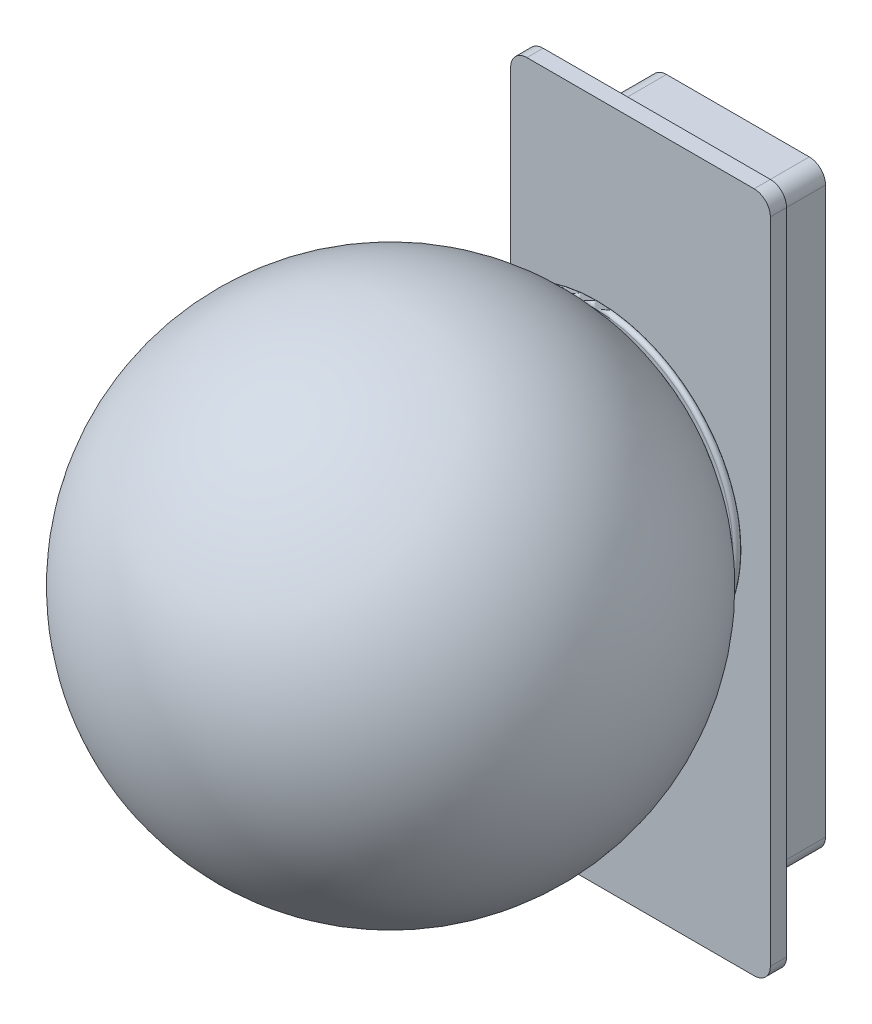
ISO-10303-21;
HEADER;
FILE_DESCRIPTION(('STEP AP214'),'2;1');
FILE_NAME('part.step','',(''),(''),'','','');
FILE_SCHEMA(('AUTOMOTIVE_DESIGN { 1 0 10303 214 1 1 1 1 }'));
ENDSEC;
DATA;
#1=APPLICATION_CONTEXT('core data for automotive mechanical design processes');
#2=APPLICATION_PROTOCOL_DEFINITION('international standard','automotive_design',2000,#1);
#3=PRODUCT_CONTEXT('',#1,'mechanical');
#4=PRODUCT('Part','Part','',(#3));
#5=PRODUCT_RELATED_PRODUCT_CATEGORY('part','',(#4));
#6=PRODUCT_DEFINITION_FORMATION('','',#4);
#7=PRODUCT_DEFINITION_CONTEXT('part definition',#1,'design');
#8=PRODUCT_DEFINITION('design','',#6,#7);
#9=PRODUCT_DEFINITION_SHAPE('','',#8);
#10=(LENGTH_UNIT() NAMED_UNIT(*) SI_UNIT(.MILLI.,.METRE.));
#11=(NAMED_UNIT(*) PLANE_ANGLE_UNIT() SI_UNIT($,.RADIAN.));
#12=(NAMED_UNIT(*) SI_UNIT($,.STERADIAN.) SOLID_ANGLE_UNIT());
#13=UNCERTAINTY_MEASURE_WITH_UNIT(LENGTH_MEASURE(1.E-05),#10,'distance_accuracy_value','');
#14=(GEOMETRIC_REPRESENTATION_CONTEXT(3) GLOBAL_UNCERTAINTY_ASSIGNED_CONTEXT((#13)) GLOBAL_UNIT_ASSIGNED_CONTEXT((#10,
#11,#12)) REPRESENTATION_CONTEXT('',''));
#15=CARTESIAN_POINT('',(0.,0.,0.));
#16=DIRECTION('',(0.,0.,1.));
#17=DIRECTION('',(1.,0.,0.));
#18=AXIS2_PLACEMENT_3D('',#15,#16,#17);
#19=CARTESIAN_POINT('',(0.,20.,85.));
#20=DIRECTION('',(0.,0.,-1.));
#21=DIRECTION('',(0.,-1.,0.));
#22=AXIS2_PLACEMENT_3D('',#19,#20,#21);
#23=SPHERICAL_SURFACE('',#22,80.);
#24=CARTESIAN_POINT('',(0.,20.,18.3372266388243));
#25=DIRECTION('',(0.,0.,-1.));
#26=DIRECTION('',(-1.,0.,0.));
#27=AXIS2_PLACEMENT_3D('',#24,#25,#26);
#28=CIRCLE('',#27,44.2275326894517);
#29=CARTESIAN_POINT('',(-44.2275326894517,20.,18.3372266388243));
#30=VERTEX_POINT('',#29);
#31=EDGE_CURVE('E11',#30,#30,#28,.T.);
#32=ORIENTED_EDGE('',*,*,#31,.T.);
#33=EDGE_LOOP('',(#32));
#34=FACE_BOUND('',#33,.T.);
#35=ADVANCED_FACE('F49',(#34),#23,.T.);
#36=CARTESIAN_POINT('',(0.,20.,19.1705113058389));
#37=DIRECTION('',(0.,0.,-1.));
#38=DIRECTION('',(-1.,0.,0.));
#39=AXIS2_PLACEMENT_3D('',#36,#37,#38);
#40=TOROIDAL_SURFACE('',#39,43.6746885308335,0.999999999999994);
#41=ORIENTED_EDGE('',*,*,#31,.F.);
#42=EDGE_LOOP('',(#41));
#43=FACE_BOUND('',#42,.T.);
#44=CARTESIAN_POINT('',(0.,20.,20.1705113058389));
#45=DIRECTION('',(0.,0.,-1.));
#46=DIRECTION('',(-1.,0.,0.));
#47=AXIS2_PLACEMENT_3D('',#44,#45,#46);
#48=CIRCLE('',#47,43.6746885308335);
#49=CARTESIAN_POINT('',(-43.6746885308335,20.,20.1705113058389));
#50=VERTEX_POINT('',#49);
#51=EDGE_CURVE('E56',#50,#50,#48,.T.);
#52=ORIENTED_EDGE('',*,*,#51,.T.);
#53=EDGE_LOOP('',(#52));
#54=FACE_BOUND('',#53,.T.);
#55=ADVANCED_FACE('F78',(#43,#54),#40,.T.);
#56=CARTESIAN_POINT('',(0.,63.6746885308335,20.1705113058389));
#57=DIRECTION('',(0.,0.,1.));
#58=DIRECTION('',(1.,0.,0.));
#59=AXIS2_PLACEMENT_3D('',#56,#57,#58);
#60=PLANE('',#59);
#61=CARTESIAN_POINT('',(0.,20.,20.1705113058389));
#62=DIRECTION('',(0.,0.,-1.));
#63=DIRECTION('',(-1.,0.,0.));
#64=AXIS2_PLACEMENT_3D('',#61,#62,#63);
#65=CIRCLE('',#64,42.4513171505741);
#66=CARTESIAN_POINT('',(-42.4513171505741,20.,20.1705113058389));
#67=VERTEX_POINT('',#66);
#68=EDGE_CURVE('E61',#67,#67,#65,.T.);
#69=ORIENTED_EDGE('',*,*,#68,.T.);
#70=EDGE_LOOP('',(#69));
#71=FACE_BOUND('',#70,.T.);
#72=ORIENTED_EDGE('',*,*,#51,.F.);
#73=EDGE_LOOP('',(#72));
#74=FACE_BOUND('',#73,.T.);
#75=ADVANCED_FACE('F69',(#71,#74),#60,.T.);
#76=CARTESIAN_POINT('',(0.,20.,81.9999999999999));
#77=DIRECTION('',(0.,0.,-1.));
#78=DIRECTION('',(0.,1.,0.));
#79=AXIS2_PLACEMENT_3D('',#76,#77,#78);
#80=SPHERICAL_SURFACE('',#79,75.);
#81=ORIENTED_EDGE('',*,*,#68,.F.);
#82=EDGE_LOOP('',(#81));
#83=FACE_BOUND('',#82,.T.);
#84=ADVANCED_FACE('F72',(#83),#80,.T.);
#85=CLOSED_SHELL('',(#35,#55,#75,#84));
#86=MANIFOLD_SOLID_BREP('B2',#85);
#87=CARTESIAN_POINT('',(-35.,-100.,0.));
#88=DIRECTION('',(0.,0.,1.));
#89=DIRECTION('',(1.,0.,0.));
#90=AXIS2_PLACEMENT_3D('',#87,#88,#89);
#91=PLANE('',#90);
#92=CARTESIAN_POINT('',(-35.,-100.,0.));
#93=DIRECTION('',(0.,0.,1.));
#94=DIRECTION('',(1.,0.,0.));
#95=AXIS2_PLACEMENT_3D('',#92,#93,#94);
#96=CIRCLE('',#95,5.);
#97=CARTESIAN_POINT('',(-40.,-100.,0.));
#98=VERTEX_POINT('',#97);
#99=CARTESIAN_POINT('',(-35.,-105.,0.));
#100=VERTEX_POINT('',#99);
#101=EDGE_CURVE('E401',#98,#100,#96,.T.);
#102=ORIENTED_EDGE('',*,*,#101,.F.);
#103=DIRECTION('',(0.,-1.,0.));
#104=VECTOR('',#103,1.);
#105=CARTESIAN_POINT('',(-40.,100.,0.));
#106=LINE('',#105,#104);
#107=CARTESIAN_POINT('',(-40.,100.,0.));
#108=VERTEX_POINT('',#107);
#109=EDGE_CURVE('E406',#108,#98,#106,.T.);
#110=ORIENTED_EDGE('',*,*,#109,.F.);
#111=CARTESIAN_POINT('',(-35.,100.,0.));
#112=DIRECTION('',(0.,0.,1.));
#113=DIRECTION('',(1.,0.,0.));
#114=AXIS2_PLACEMENT_3D('',#111,#112,#113);
#115=CIRCLE('',#114,5.);
#116=CARTESIAN_POINT('',(-35.,105.,0.));
#117=VERTEX_POINT('',#116);
#118=EDGE_CURVE('E433',#117,#108,#115,.T.);
#119=ORIENTED_EDGE('',*,*,#118,.F.);
#120=DIRECTION('',(-1.,0.,0.));
#121=VECTOR('',#120,1.);
#122=CARTESIAN_POINT('',(35.,105.,0.));
#123=LINE('',#122,#121);
#124=CARTESIAN_POINT('',(35.,105.,0.));
#125=VERTEX_POINT('',#124);
#126=EDGE_CURVE('E431',#125,#117,#123,.T.);
#127=ORIENTED_EDGE('',*,*,#126,.F.);
#128=CARTESIAN_POINT('',(35.,100.,0.));
#129=DIRECTION('',(0.,0.,1.));
#130=DIRECTION('',(1.,0.,0.));
#131=AXIS2_PLACEMENT_3D('',#128,#129,#130);
#132=CIRCLE('',#131,5.);
#133=CARTESIAN_POINT('',(40.,100.,0.));
#134=VERTEX_POINT('',#133);
#135=EDGE_CURVE('E429',#134,#125,#132,.T.);
#136=ORIENTED_EDGE('',*,*,#135,.F.);
#137=DIRECTION('',(0.,1.,0.));
#138=VECTOR('',#137,1.);
#139=CARTESIAN_POINT('',(40.,100.,0.));
#140=LINE('',#139,#138);
#141=CARTESIAN_POINT('',(40.,-100.,0.));
#142=VERTEX_POINT('',#141);
#143=EDGE_CURVE('E427',#142,#134,#140,.T.);
#144=ORIENTED_EDGE('',*,*,#143,.F.);
#145=CARTESIAN_POINT('',(35.,-100.,0.));
#146=DIRECTION('',(0.,0.,1.));
#147=DIRECTION('',(1.,0.,0.));
#148=AXIS2_PLACEMENT_3D('',#145,#146,#147);
#149=CIRCLE('',#148,5.);
#150=CARTESIAN_POINT('',(35.,-105.,0.));
#151=VERTEX_POINT('',#150);
#152=EDGE_CURVE('E425',#151,#142,#149,.T.);
#153=ORIENTED_EDGE('',*,*,#152,.F.);
#154=DIRECTION('',(1.,0.,0.));
#155=VECTOR('',#154,1.);
#156=CARTESIAN_POINT('',(35.,-105.,0.));
#157=LINE('',#156,#155);
#158=EDGE_CURVE('E423',#100,#151,#157,.T.);
#159=ORIENTED_EDGE('',*,*,#158,.F.);
#160=EDGE_LOOP('',(#102,#110,#119,#127,#136,#144,#153,#159));
#161=FACE_BOUND('',#160,.T.);
#162=CARTESIAN_POINT('',(-22.,-87.,0.));
#163=DIRECTION('',(0.,0.,-1.));
#164=DIRECTION('',(1.,0.,0.));
#165=AXIS2_PLACEMENT_3D('',#162,#163,#164);
#166=CIRCLE('',#165,5.);
#167=CARTESIAN_POINT('',(-22.,-92.,0.));
#168=VERTEX_POINT('',#167);
#169=CARTESIAN_POINT('',(-27.,-87.,0.));
#170=VERTEX_POINT('',#169);
#171=EDGE_CURVE('E131',#168,#170,#166,.T.);
#172=ORIENTED_EDGE('',*,*,#171,.F.);
#173=DIRECTION('',(-1.,0.,0.));
#174=VECTOR('',#173,1.);
#175=CARTESIAN_POINT('',(22.,-92.,0.));
#176=LINE('',#175,#174);
#177=CARTESIAN_POINT('',(22.,-92.,0.));
#178=VERTEX_POINT('',#177);
#179=EDGE_CURVE('E343',#178,#168,#176,.T.);
#180=ORIENTED_EDGE('',*,*,#179,.F.);
#181=CARTESIAN_POINT('',(22.,-87.,0.));
#182=DIRECTION('',(0.,0.,-1.));
#183=DIRECTION('',(1.,0.,0.));
#184=AXIS2_PLACEMENT_3D('',#181,#182,#183);
#185=CIRCLE('',#184,5.);
#186=CARTESIAN_POINT('',(27.,-87.,0.));
#187=VERTEX_POINT('',#186);
#188=EDGE_CURVE('E374',#187,#178,#185,.T.);
#189=ORIENTED_EDGE('',*,*,#188,.F.);
#190=DIRECTION('',(0.,-1.,0.));
#191=VECTOR('',#190,1.);
#192=CARTESIAN_POINT('',(27.,87.,0.));
#193=LINE('',#192,#191);
#194=CARTESIAN_POINT('',(27.,87.,0.));
#195=VERTEX_POINT('',#194);
#196=EDGE_CURVE('E371',#195,#187,#193,.T.);
#197=ORIENTED_EDGE('',*,*,#196,.F.);
#198=CARTESIAN_POINT('',(22.,87.,0.));
#199=DIRECTION('',(0.,0.,-1.));
#200=DIRECTION('',(-1.,0.,0.));
#201=AXIS2_PLACEMENT_3D('',#198,#199,#200);
#202=CIRCLE('',#201,5.);
#203=CARTESIAN_POINT('',(21.9999999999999,92.,0.));
#204=VERTEX_POINT('',#203);
#205=EDGE_CURVE('E368',#204,#195,#202,.T.);
#206=ORIENTED_EDGE('',*,*,#205,.F.);
#207=DIRECTION('',(1.,0.,0.));
#208=VECTOR('',#207,1.);
#209=CARTESIAN_POINT('',(-22.,92.,0.));
#210=LINE('',#209,#208);
#211=CARTESIAN_POINT('',(-22.,92.,0.));
#212=VERTEX_POINT('',#211);
#213=EDGE_CURVE('E365',#212,#204,#210,.T.);
#214=ORIENTED_EDGE('',*,*,#213,.F.);
#215=CARTESIAN_POINT('',(-22.,87.,0.));
#216=DIRECTION('',(0.,0.,-1.));
#217=DIRECTION('',(-1.,0.,0.));
#218=AXIS2_PLACEMENT_3D('',#215,#216,#217);
#219=CIRCLE('',#218,5.);
#220=CARTESIAN_POINT('',(-27.,87.,0.));
#221=VERTEX_POINT('',#220);
#222=EDGE_CURVE('E362',#221,#212,#219,.T.);
#223=ORIENTED_EDGE('',*,*,#222,.F.);
#224=DIRECTION('',(0.,1.,0.));
#225=VECTOR('',#224,1.);
#226=CARTESIAN_POINT('',(-27.,-87.,0.));
#227=LINE('',#226,#225);
#228=EDGE_CURVE('E359',#170,#221,#227,.T.);
#229=ORIENTED_EDGE('',*,*,#228,.F.);
#230=EDGE_LOOP('',(#172,#180,#189,#197,#206,#214,#223,#229));
#231=FACE_BOUND('',#230,.T.);
#232=ADVANCED_FACE('F108',(#161,#231),#91,.F.);
#233=CARTESIAN_POINT('',(-35.,-100.,5.));
#234=DIRECTION('',(0.,0.,-1.));
#235=DIRECTION('',(-1.,0.,0.));
#236=AXIS2_PLACEMENT_3D('',#233,#234,#235);
#237=CYLINDRICAL_SURFACE('',#236,5.);
#238=ORIENTED_EDGE('',*,*,#101,.T.);
#239=DIRECTION('',(0.,0.,-1.));
#240=VECTOR('',#239,1.);
#241=CARTESIAN_POINT('',(-35.,-105.,5.));
#242=LINE('',#241,#240);
#243=CARTESIAN_POINT('',(-35.,-105.,5.));
#244=VERTEX_POINT('',#243);
#245=EDGE_CURVE('E47',#244,#100,#242,.T.);
#246=ORIENTED_EDGE('',*,*,#245,.F.);
#247=CARTESIAN_POINT('',(-35.,-100.,5.));
#248=DIRECTION('',(0.,0.,1.));
#249=DIRECTION('',(1.,0.,0.));
#250=AXIS2_PLACEMENT_3D('',#247,#248,#249);
#251=CIRCLE('',#250,5.);
#252=CARTESIAN_POINT('',(-40.,-100.,5.));
#253=VERTEX_POINT('',#252);
#254=EDGE_CURVE('E402',#253,#244,#251,.T.);
#255=ORIENTED_EDGE('',*,*,#254,.F.);
#256=DIRECTION('',(0.,0.,-1.));
#257=VECTOR('',#256,1.);
#258=CARTESIAN_POINT('',(-40.,-100.,5.));
#259=LINE('',#258,#257);
#260=EDGE_CURVE('E420',#253,#98,#259,.T.);
#261=ORIENTED_EDGE('',*,*,#260,.T.);
#262=EDGE_LOOP('',(#238,#246,#255,#261));
#263=FACE_BOUND('',#262,.T.);
#264=ADVANCED_FACE('F110',(#263),#237,.T.);
#265=CARTESIAN_POINT('',(35.,-105.,5.));
#266=DIRECTION('',(0.,1.,0.));
#267=DIRECTION('',(0.,0.,1.));
#268=AXIS2_PLACEMENT_3D('',#265,#266,#267);
#269=PLANE('',#268);
#270=ORIENTED_EDGE('',*,*,#158,.T.);
#271=DIRECTION('',(0.,0.,-1.));
#272=VECTOR('',#271,1.);
#273=CARTESIAN_POINT('',(35.,-105.,5.));
#274=LINE('',#273,#272);
#275=CARTESIAN_POINT('',(35.,-105.,5.));
#276=VERTEX_POINT('',#275);
#277=EDGE_CURVE('E116',#276,#151,#274,.T.);
#278=ORIENTED_EDGE('',*,*,#277,.F.);
#279=DIRECTION('',(1.,0.,0.));
#280=VECTOR('',#279,1.);
#281=CARTESIAN_POINT('',(35.,-105.,5.));
#282=LINE('',#281,#280);
#283=EDGE_CURVE('E405',#244,#276,#282,.T.);
#284=ORIENTED_EDGE('',*,*,#283,.F.);
#285=ORIENTED_EDGE('',*,*,#245,.T.);
#286=EDGE_LOOP('',(#270,#278,#284,#285));
#287=FACE_BOUND('',#286,.T.);
#288=ADVANCED_FACE('F479',(#287),#269,.F.);
#289=CARTESIAN_POINT('',(35.,-100.,5.));
#290=DIRECTION('',(0.,0.,-1.));
#291=DIRECTION('',(-1.,0.,0.));
#292=AXIS2_PLACEMENT_3D('',#289,#290,#291);
#293=CYLINDRICAL_SURFACE('',#292,5.);
#294=ORIENTED_EDGE('',*,*,#152,.T.);
#295=DIRECTION('',(0.,0.,-1.));
#296=VECTOR('',#295,1.);
#297=CARTESIAN_POINT('',(40.,-100.,5.));
#298=LINE('',#297,#296);
#299=CARTESIAN_POINT('',(40.,-100.,5.));
#300=VERTEX_POINT('',#299);
#301=EDGE_CURVE('E450',#300,#142,#298,.T.);
#302=ORIENTED_EDGE('',*,*,#301,.F.);
#303=CARTESIAN_POINT('',(35.,-100.,5.));
#304=DIRECTION('',(0.,0.,1.));
#305=DIRECTION('',(1.,0.,0.));
#306=AXIS2_PLACEMENT_3D('',#303,#304,#305);
#307=CIRCLE('',#306,5.);
#308=EDGE_CURVE('E408',#276,#300,#307,.T.);
#309=ORIENTED_EDGE('',*,*,#308,.F.);
#310=ORIENTED_EDGE('',*,*,#277,.T.);
#311=EDGE_LOOP('',(#294,#302,#309,#310));
#312=FACE_BOUND('',#311,.T.);
#313=ADVANCED_FACE('F457',(#312),#293,.T.);
#314=CARTESIAN_POINT('',(40.,100.,5.));
#315=DIRECTION('',(-1.,0.,0.));
#316=DIRECTION('',(0.,-1.,0.));
#317=AXIS2_PLACEMENT_3D('',#314,#315,#316);
#318=PLANE('',#317);
#319=ORIENTED_EDGE('',*,*,#143,.T.);
#320=DIRECTION('',(0.,0.,-1.));
#321=VECTOR('',#320,1.);
#322=CARTESIAN_POINT('',(40.,100.,5.));
#323=LINE('',#322,#321);
#324=CARTESIAN_POINT('',(40.,100.,5.));
#325=VERTEX_POINT('',#324);
#326=EDGE_CURVE('E447',#325,#134,#323,.T.);
#327=ORIENTED_EDGE('',*,*,#326,.F.);
#328=DIRECTION('',(0.,1.,0.));
#329=VECTOR('',#328,1.);
#330=CARTESIAN_POINT('',(40.,100.,5.));
#331=LINE('',#330,#329);
#332=EDGE_CURVE('E410',#300,#325,#331,.T.);
#333=ORIENTED_EDGE('',*,*,#332,.F.);
#334=ORIENTED_EDGE('',*,*,#301,.T.);
#335=EDGE_LOOP('',(#319,#327,#333,#334));
#336=FACE_BOUND('',#335,.T.);
#337=ADVANCED_FACE('F467',(#336),#318,.F.);
#338=CARTESIAN_POINT('',(35.,100.,5.));
#339=DIRECTION('',(0.,0.,-1.));
#340=DIRECTION('',(-1.,0.,0.));
#341=AXIS2_PLACEMENT_3D('',#338,#339,#340);
#342=CYLINDRICAL_SURFACE('',#341,5.);
#343=ORIENTED_EDGE('',*,*,#135,.T.);
#344=DIRECTION('',(0.,0.,-1.));
#345=VECTOR('',#344,1.);
#346=CARTESIAN_POINT('',(35.,105.,5.));
#347=LINE('',#346,#345);
#348=CARTESIAN_POINT('',(35.,105.,5.));
#349=VERTEX_POINT('',#348);
#350=EDGE_CURVE('E444',#349,#125,#347,.T.);
#351=ORIENTED_EDGE('',*,*,#350,.F.);
#352=CARTESIAN_POINT('',(35.,100.,5.));
#353=DIRECTION('',(0.,0.,1.));
#354=DIRECTION('',(1.,0.,0.));
#355=AXIS2_PLACEMENT_3D('',#352,#353,#354);
#356=CIRCLE('',#355,5.);
#357=EDGE_CURVE('E412',#325,#349,#356,.T.);
#358=ORIENTED_EDGE('',*,*,#357,.F.);
#359=ORIENTED_EDGE('',*,*,#326,.T.);
#360=EDGE_LOOP('',(#343,#351,#358,#359));
#361=FACE_BOUND('',#360,.T.);
#362=ADVANCED_FACE('F471',(#361),#342,.T.);
#363=CARTESIAN_POINT('',(35.,105.,5.));
#364=DIRECTION('',(0.,-1.,0.));
#365=DIRECTION('',(0.,0.,-1.));
#366=AXIS2_PLACEMENT_3D('',#363,#364,#365);
#367=PLANE('',#366);
#368=ORIENTED_EDGE('',*,*,#126,.T.);
#369=DIRECTION('',(0.,0.,-1.));
#370=VECTOR('',#369,1.);
#371=CARTESIAN_POINT('',(-35.,105.,5.));
#372=LINE('',#371,#370);
#373=CARTESIAN_POINT('',(-35.,105.,5.));
#374=VERTEX_POINT('',#373);
#375=EDGE_CURVE('E441',#374,#117,#372,.T.);
#376=ORIENTED_EDGE('',*,*,#375,.F.);
#377=DIRECTION('',(-1.,0.,0.));
#378=VECTOR('',#377,1.);
#379=CARTESIAN_POINT('',(35.,105.,5.));
#380=LINE('',#379,#378);
#381=EDGE_CURVE('E414',#349,#374,#380,.T.);
#382=ORIENTED_EDGE('',*,*,#381,.F.);
#383=ORIENTED_EDGE('',*,*,#350,.T.);
#384=EDGE_LOOP('',(#368,#376,#382,#383));
#385=FACE_BOUND('',#384,.T.);
#386=ADVANCED_FACE('F492',(#385),#367,.F.);
#387=CARTESIAN_POINT('',(-35.,100.,5.));
#388=DIRECTION('',(0.,0.,-1.));
#389=DIRECTION('',(-1.,0.,0.));
#390=AXIS2_PLACEMENT_3D('',#387,#388,#389);
#391=CYLINDRICAL_SURFACE('',#390,5.);
#392=ORIENTED_EDGE('',*,*,#118,.T.);
#393=DIRECTION('',(0.,0.,-1.));
#394=VECTOR('',#393,1.);
#395=CARTESIAN_POINT('',(-40.,100.,5.));
#396=LINE('',#395,#394);
#397=CARTESIAN_POINT('',(-40.,100.,5.));
#398=VERTEX_POINT('',#397);
#399=EDGE_CURVE('E438',#398,#108,#396,.T.);
#400=ORIENTED_EDGE('',*,*,#399,.F.);
#401=CARTESIAN_POINT('',(-35.,100.,5.));
#402=DIRECTION('',(0.,0.,1.));
#403=DIRECTION('',(1.,0.,0.));
#404=AXIS2_PLACEMENT_3D('',#401,#402,#403);
#405=CIRCLE('',#404,5.);
#406=EDGE_CURVE('E416',#374,#398,#405,.T.);
#407=ORIENTED_EDGE('',*,*,#406,.F.);
#408=ORIENTED_EDGE('',*,*,#375,.T.);
#409=EDGE_LOOP('',(#392,#400,#407,#408));
#410=FACE_BOUND('',#409,.T.);
#411=ADVANCED_FACE('F490',(#410),#391,.T.);
#412=CARTESIAN_POINT('',(-40.,100.,5.));
#413=DIRECTION('',(1.,0.,0.));
#414=DIRECTION('',(0.,1.,0.));
#415=AXIS2_PLACEMENT_3D('',#412,#413,#414);
#416=PLANE('',#415);
#417=ORIENTED_EDGE('',*,*,#109,.T.);
#418=ORIENTED_EDGE('',*,*,#260,.F.);
#419=DIRECTION('',(0.,-1.,0.));
#420=VECTOR('',#419,1.);
#421=CARTESIAN_POINT('',(-40.,100.,5.));
#422=LINE('',#421,#420);
#423=EDGE_CURVE('E418',#398,#253,#422,.T.);
#424=ORIENTED_EDGE('',*,*,#423,.F.);
#425=ORIENTED_EDGE('',*,*,#399,.T.);
#426=EDGE_LOOP('',(#417,#418,#424,#425));
#427=FACE_BOUND('',#426,.T.);
#428=ADVANCED_FACE('F485',(#427),#416,.F.);
#429=CARTESIAN_POINT('',(-35.,-100.,5.));
#430=DIRECTION('',(0.,0.,1.));
#431=DIRECTION('',(1.,0.,0.));
#432=AXIS2_PLACEMENT_3D('',#429,#430,#431);
#433=PLANE('',#432);
#434=ORIENTED_EDGE('',*,*,#254,.T.);
#435=ORIENTED_EDGE('',*,*,#283,.T.);
#436=ORIENTED_EDGE('',*,*,#308,.T.);
#437=ORIENTED_EDGE('',*,*,#332,.T.);
#438=ORIENTED_EDGE('',*,*,#357,.T.);
#439=ORIENTED_EDGE('',*,*,#381,.T.);
#440=ORIENTED_EDGE('',*,*,#406,.T.);
#441=ORIENTED_EDGE('',*,*,#423,.T.);
#442=EDGE_LOOP('',(#434,#435,#436,#437,#438,#439,#440,#441));
#443=FACE_BOUND('',#442,.T.);
#444=ADVANCED_FACE('F475',(#443),#433,.T.);
#445=CARTESIAN_POINT('',(-22.,-87.,-25.));
#446=DIRECTION('',(0.,0.,1.));
#447=DIRECTION('',(1.,0.,0.));
#448=AXIS2_PLACEMENT_3D('',#445,#446,#447);
#449=CYLINDRICAL_SURFACE('',#448,5.);
#450=ORIENTED_EDGE('',*,*,#171,.T.);
#451=DIRECTION('',(0.,0.,1.));
#452=VECTOR('',#451,1.);
#453=CARTESIAN_POINT('',(-27.,-87.,-25.));
#454=LINE('',#453,#452);
#455=CARTESIAN_POINT('',(-27.,-87.,-25.));
#456=VERTEX_POINT('',#455);
#457=EDGE_CURVE('E398',#456,#170,#454,.T.);
#458=ORIENTED_EDGE('',*,*,#457,.F.);
#459=CARTESIAN_POINT('',(-22.,-87.,-25.));
#460=DIRECTION('',(0.,0.,-1.));
#461=DIRECTION('',(1.,0.,0.));
#462=AXIS2_PLACEMENT_3D('',#459,#460,#461);
#463=CIRCLE('',#462,5.);
#464=CARTESIAN_POINT('',(-22.,-92.,-25.));
#465=VERTEX_POINT('',#464);
#466=EDGE_CURVE('E339',#465,#456,#463,.T.);
#467=ORIENTED_EDGE('',*,*,#466,.F.);
#468=DIRECTION('',(0.,0.,1.));
#469=VECTOR('',#468,1.);
#470=CARTESIAN_POINT('',(-22.,-92.,-25.));
#471=LINE('',#470,#469);
#472=EDGE_CURVE('E357',#465,#168,#471,.T.);
#473=ORIENTED_EDGE('',*,*,#472,.T.);
#474=EDGE_LOOP('',(#450,#458,#467,#473));
#475=FACE_BOUND('',#474,.T.);
#476=ADVANCED_FACE('F513',(#475),#449,.T.);
#477=CARTESIAN_POINT('',(-27.,-87.,-25.));
#478=DIRECTION('',(1.,0.,0.));
#479=DIRECTION('',(0.,1.,0.));
#480=AXIS2_PLACEMENT_3D('',#477,#478,#479);
#481=PLANE('',#480);
#482=ORIENTED_EDGE('',*,*,#228,.T.);
#483=DIRECTION('',(0.,0.,1.));
#484=VECTOR('',#483,1.);
#485=CARTESIAN_POINT('',(-27.,87.,-25.));
#486=LINE('',#485,#484);
#487=CARTESIAN_POINT('',(-27.,87.,-25.));
#488=VERTEX_POINT('',#487);
#489=EDGE_CURVE('E395',#488,#221,#486,.T.);
#490=ORIENTED_EDGE('',*,*,#489,.F.);
#491=DIRECTION('',(0.,1.,0.));
#492=VECTOR('',#491,1.);
#493=CARTESIAN_POINT('',(-27.,-87.,-25.));
#494=LINE('',#493,#492);
#495=EDGE_CURVE('E342',#456,#488,#494,.T.);
#496=ORIENTED_EDGE('',*,*,#495,.F.);
#497=ORIENTED_EDGE('',*,*,#457,.T.);
#498=EDGE_LOOP('',(#482,#490,#496,#497));
#499=FACE_BOUND('',#498,.T.);
#500=ADVANCED_FACE('F517',(#499),#481,.F.);
#501=CARTESIAN_POINT('',(-22.,87.,-25.));
#502=DIRECTION('',(0.,0.,1.));
#503=DIRECTION('',(1.,0.,0.));
#504=AXIS2_PLACEMENT_3D('',#501,#502,#503);
#505=CYLINDRICAL_SURFACE('',#504,5.);
#506=ORIENTED_EDGE('',*,*,#222,.T.);
#507=DIRECTION('',(0.,0.,1.));
#508=VECTOR('',#507,1.);
#509=CARTESIAN_POINT('',(-22.,92.,-25.));
#510=LINE('',#509,#508);
#511=CARTESIAN_POINT('',(-22.,92.,-25.));
#512=VERTEX_POINT('',#511);
#513=EDGE_CURVE('E392',#512,#212,#510,.T.);
#514=ORIENTED_EDGE('',*,*,#513,.F.);
#515=CARTESIAN_POINT('',(-22.,87.,-25.));
#516=DIRECTION('',(0.,0.,-1.));
#517=DIRECTION('',(-1.,0.,0.));
#518=AXIS2_PLACEMENT_3D('',#515,#516,#517);
#519=CIRCLE('',#518,5.);
#520=EDGE_CURVE('E345',#488,#512,#519,.T.);
#521=ORIENTED_EDGE('',*,*,#520,.F.);
#522=ORIENTED_EDGE('',*,*,#489,.T.);
#523=EDGE_LOOP('',(#506,#514,#521,#522));
#524=FACE_BOUND('',#523,.T.);
#525=ADVANCED_FACE('F522',(#524),#505,.T.);
#526=CARTESIAN_POINT('',(-22.,92.,-25.));
#527=DIRECTION('',(0.,-1.,0.));
#528=DIRECTION('',(0.,0.,-1.));
#529=AXIS2_PLACEMENT_3D('',#526,#527,#528);
#530=PLANE('',#529);
#531=ORIENTED_EDGE('',*,*,#213,.T.);
#532=DIRECTION('',(0.,0.,1.));
#533=VECTOR('',#532,1.);
#534=CARTESIAN_POINT('',(21.9999999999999,92.,-25.));
#535=LINE('',#534,#533);
#536=CARTESIAN_POINT('',(21.9999999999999,92.,-25.));
#537=VERTEX_POINT('',#536);
#538=EDGE_CURVE('E389',#537,#204,#535,.T.);
#539=ORIENTED_EDGE('',*,*,#538,.F.);
#540=DIRECTION('',(1.,0.,0.));
#541=VECTOR('',#540,1.);
#542=CARTESIAN_POINT('',(-22.,92.,-25.));
#543=LINE('',#542,#541);
#544=EDGE_CURVE('E347',#512,#537,#543,.T.);
#545=ORIENTED_EDGE('',*,*,#544,.F.);
#546=ORIENTED_EDGE('',*,*,#513,.T.);
#547=EDGE_LOOP('',(#531,#539,#545,#546));
#548=FACE_BOUND('',#547,.T.);
#549=ADVANCED_FACE('F528',(#548),#530,.F.);
#550=CARTESIAN_POINT('',(22.,87.,-25.));
#551=DIRECTION('',(0.,0.,1.));
#552=DIRECTION('',(1.,0.,0.));
#553=AXIS2_PLACEMENT_3D('',#550,#551,#552);
#554=CYLINDRICAL_SURFACE('',#553,5.);
#555=ORIENTED_EDGE('',*,*,#205,.T.);
#556=DIRECTION('',(0.,0.,1.));
#557=VECTOR('',#556,1.);
#558=CARTESIAN_POINT('',(27.,87.,-25.));
#559=LINE('',#558,#557);
#560=CARTESIAN_POINT('',(27.,87.,-25.));
#561=VERTEX_POINT('',#560);
#562=EDGE_CURVE('E386',#561,#195,#559,.T.);
#563=ORIENTED_EDGE('',*,*,#562,.F.);
#564=CARTESIAN_POINT('',(22.,87.,-25.));
#565=DIRECTION('',(0.,0.,-1.));
#566=DIRECTION('',(-1.,0.,0.));
#567=AXIS2_PLACEMENT_3D('',#564,#565,#566);
#568=CIRCLE('',#567,5.);
#569=EDGE_CURVE('E349',#537,#561,#568,.T.);
#570=ORIENTED_EDGE('',*,*,#569,.F.);
#571=ORIENTED_EDGE('',*,*,#538,.T.);
#572=EDGE_LOOP('',(#555,#563,#570,#571));
#573=FACE_BOUND('',#572,.T.);
#574=ADVANCED_FACE('F532',(#573),#554,.T.);
#575=CARTESIAN_POINT('',(27.,87.,-25.));
#576=DIRECTION('',(-1.,0.,0.));
#577=DIRECTION('',(0.,-1.,0.));
#578=AXIS2_PLACEMENT_3D('',#575,#576,#577);
#579=PLANE('',#578);
#580=ORIENTED_EDGE('',*,*,#196,.T.);
#581=DIRECTION('',(0.,0.,1.));
#582=VECTOR('',#581,1.);
#583=CARTESIAN_POINT('',(27.,-87.,-25.));
#584=LINE('',#583,#582);
#585=CARTESIAN_POINT('',(27.,-87.,-25.));
#586=VERTEX_POINT('',#585);
#587=EDGE_CURVE('E383',#586,#187,#584,.T.);
#588=ORIENTED_EDGE('',*,*,#587,.F.);
#589=DIRECTION('',(0.,-1.,0.));
#590=VECTOR('',#589,1.);
#591=CARTESIAN_POINT('',(27.,87.,-25.));
#592=LINE('',#591,#590);
#593=EDGE_CURVE('E351',#561,#586,#592,.T.);
#594=ORIENTED_EDGE('',*,*,#593,.F.);
#595=ORIENTED_EDGE('',*,*,#562,.T.);
#596=EDGE_LOOP('',(#580,#588,#594,#595));
#597=FACE_BOUND('',#596,.T.);
#598=ADVANCED_FACE('F536',(#597),#579,.F.);
#599=CARTESIAN_POINT('',(22.,-87.,-25.));
#600=DIRECTION('',(0.,0.,1.));
#601=DIRECTION('',(1.,0.,0.));
#602=AXIS2_PLACEMENT_3D('',#599,#600,#601);
#603=CYLINDRICAL_SURFACE('',#602,5.);
#604=ORIENTED_EDGE('',*,*,#188,.T.);
#605=DIRECTION('',(0.,0.,1.));
#606=VECTOR('',#605,1.);
#607=CARTESIAN_POINT('',(22.,-92.,-25.));
#608=LINE('',#607,#606);
#609=CARTESIAN_POINT('',(22.,-92.,-25.));
#610=VERTEX_POINT('',#609);
#611=EDGE_CURVE('E380',#610,#178,#608,.T.);
#612=ORIENTED_EDGE('',*,*,#611,.F.);
#613=CARTESIAN_POINT('',(22.,-87.,-25.));
#614=DIRECTION('',(0.,0.,-1.));
#615=DIRECTION('',(1.,0.,0.));
#616=AXIS2_PLACEMENT_3D('',#613,#614,#615);
#617=CIRCLE('',#616,5.);
#618=EDGE_CURVE('E353',#586,#610,#617,.T.);
#619=ORIENTED_EDGE('',*,*,#618,.F.);
#620=ORIENTED_EDGE('',*,*,#587,.T.);
#621=EDGE_LOOP('',(#604,#612,#619,#620));
#622=FACE_BOUND('',#621,.T.);
#623=ADVANCED_FACE('F540',(#622),#603,.T.);
#624=CARTESIAN_POINT('',(22.,-92.,-25.));
#625=DIRECTION('',(0.,1.,0.));
#626=DIRECTION('',(0.,0.,1.));
#627=AXIS2_PLACEMENT_3D('',#624,#625,#626);
#628=PLANE('',#627);
#629=ORIENTED_EDGE('',*,*,#179,.T.);
#630=ORIENTED_EDGE('',*,*,#472,.F.);
#631=DIRECTION('',(-1.,0.,0.));
#632=VECTOR('',#631,1.);
#633=CARTESIAN_POINT('',(22.,-92.,-25.));
#634=LINE('',#633,#632);
#635=EDGE_CURVE('E355',#610,#465,#634,.T.);
#636=ORIENTED_EDGE('',*,*,#635,.F.);
#637=ORIENTED_EDGE('',*,*,#611,.T.);
#638=EDGE_LOOP('',(#629,#630,#636,#637));
#639=FACE_BOUND('',#638,.T.);
#640=ADVANCED_FACE('F544',(#639),#628,.F.);
#641=CARTESIAN_POINT('',(-22.,-87.,-25.));
#642=DIRECTION('',(0.,0.,1.));
#643=DIRECTION('',(1.,0.,0.));
#644=AXIS2_PLACEMENT_3D('',#641,#642,#643);
#645=PLANE('',#644);
#646=DIRECTION('',(1.,0.,0.));
#647=VECTOR('',#646,1.);
#648=CARTESIAN_POINT('',(-22.,89.,-25.));
#649=LINE('',#648,#647);
#650=CARTESIAN_POINT('',(-22.,89.,-25.));
#651=VERTEX_POINT('',#650);
#652=CARTESIAN_POINT('',(21.9999999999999,89.,-25.));
#653=VERTEX_POINT('',#652);
#654=EDGE_CURVE('E310',#651,#653,#649,.T.);
#655=ORIENTED_EDGE('',*,*,#654,.F.);
#656=CARTESIAN_POINT('',(-22.,87.,-25.));
#657=DIRECTION('',(0.,0.,-1.));
#658=DIRECTION('',(-1.,0.,0.));
#659=AXIS2_PLACEMENT_3D('',#656,#657,#658);
#660=CIRCLE('',#659,2.);
#661=CARTESIAN_POINT('',(-24.,87.,-25.));
#662=VERTEX_POINT('',#661);
#663=EDGE_CURVE('E123',#662,#651,#660,.T.);
#664=ORIENTED_EDGE('',*,*,#663,.F.);
#665=DIRECTION('',(0.,1.,0.));
#666=VECTOR('',#665,1.);
#667=CARTESIAN_POINT('',(-24.,-87.,-25.));
#668=LINE('',#667,#666);
#669=CARTESIAN_POINT('',(-24.,-87.,-25.));
#670=VERTEX_POINT('',#669);
#671=EDGE_CURVE('E290',#670,#662,#668,.T.);
#672=ORIENTED_EDGE('',*,*,#671,.F.);
#673=CARTESIAN_POINT('',(-22.,-87.,-25.));
#674=DIRECTION('',(0.,0.,-1.));
#675=DIRECTION('',(-1.,0.,0.));
#676=AXIS2_PLACEMENT_3D('',#673,#674,#675);
#677=CIRCLE('',#676,2.);
#678=CARTESIAN_POINT('',(-22.,-89.,-25.));
#679=VERTEX_POINT('',#678);
#680=EDGE_CURVE('E293',#679,#670,#677,.T.);
#681=ORIENTED_EDGE('',*,*,#680,.F.);
#682=DIRECTION('',(-1.,0.,0.));
#683=VECTOR('',#682,1.);
#684=CARTESIAN_POINT('',(22.,-89.,-25.));
#685=LINE('',#684,#683);
#686=CARTESIAN_POINT('',(22.,-89.,-25.));
#687=VERTEX_POINT('',#686);
#688=EDGE_CURVE('E321',#687,#679,#685,.T.);
#689=ORIENTED_EDGE('',*,*,#688,.F.);
#690=CARTESIAN_POINT('',(22.,-87.,-25.));
#691=DIRECTION('',(0.,0.,-1.));
#692=DIRECTION('',(-1.,0.,0.));
#693=AXIS2_PLACEMENT_3D('',#690,#691,#692);
#694=CIRCLE('',#693,2.);
#695=CARTESIAN_POINT('',(24.,-87.,-25.));
#696=VERTEX_POINT('',#695);
#697=EDGE_CURVE('E318',#696,#687,#694,.T.);
#698=ORIENTED_EDGE('',*,*,#697,.F.);
#699=DIRECTION('',(0.,-1.,0.));
#700=VECTOR('',#699,1.);
#701=CARTESIAN_POINT('',(24.,87.,-25.));
#702=LINE('',#701,#700);
#703=CARTESIAN_POINT('',(24.,87.,-25.));
#704=VERTEX_POINT('',#703);
#705=EDGE_CURVE('E315',#704,#696,#702,.T.);
#706=ORIENTED_EDGE('',*,*,#705,.F.);
#707=CARTESIAN_POINT('',(22.,87.,-25.));
#708=DIRECTION('',(0.,0.,-1.));
#709=DIRECTION('',(-1.,0.,0.));
#710=AXIS2_PLACEMENT_3D('',#707,#708,#709);
#711=CIRCLE('',#710,2.);
#712=EDGE_CURVE('E312',#653,#704,#711,.T.);
#713=ORIENTED_EDGE('',*,*,#712,.F.);
#714=EDGE_LOOP('',(#655,#664,#672,#681,#689,#698,#706,#713));
#715=FACE_BOUND('',#714,.T.);
#716=ORIENTED_EDGE('',*,*,#466,.T.);
#717=ORIENTED_EDGE('',*,*,#495,.T.);
#718=ORIENTED_EDGE('',*,*,#520,.T.);
#719=ORIENTED_EDGE('',*,*,#544,.T.);
#720=ORIENTED_EDGE('',*,*,#569,.T.);
#721=ORIENTED_EDGE('',*,*,#593,.T.);
#722=ORIENTED_EDGE('',*,*,#618,.T.);
#723=ORIENTED_EDGE('',*,*,#635,.T.);
#724=EDGE_LOOP('',(#716,#717,#718,#719,#720,#721,#722,#723));
#725=FACE_BOUND('',#724,.T.);
#726=ADVANCED_FACE('F548',(#715,#725),#645,.F.);
#727=CARTESIAN_POINT('',(-22.,87.,-10.));
#728=DIRECTION('',(0.,0.,-1.));
#729=DIRECTION('',(-1.,0.,0.));
#730=AXIS2_PLACEMENT_3D('',#727,#728,#729);
#731=CYLINDRICAL_SURFACE('',#730,2.);
#732=ORIENTED_EDGE('',*,*,#663,.T.);
#733=DIRECTION('',(0.,0.,-1.));
#734=VECTOR('',#733,1.);
#735=CARTESIAN_POINT('',(-22.,89.,-10.));
#736=LINE('',#735,#734);
#737=CARTESIAN_POINT('',(-22.,89.,-10.));
#738=VERTEX_POINT('',#737);
#739=EDGE_CURVE('E267',#738,#651,#736,.T.);
#740=ORIENTED_EDGE('',*,*,#739,.F.);
#741=CARTESIAN_POINT('',(-22.,87.,-10.));
#742=DIRECTION('',(0.,0.,-1.));
#743=DIRECTION('',(-1.,0.,0.));
#744=AXIS2_PLACEMENT_3D('',#741,#742,#743);
#745=CIRCLE('',#744,2.);
#746=CARTESIAN_POINT('',(-24.,87.,-10.));
#747=VERTEX_POINT('',#746);
#748=EDGE_CURVE('E271',#747,#738,#745,.T.);
#749=ORIENTED_EDGE('',*,*,#748,.F.);
#750=DIRECTION('',(0.,0.,-1.));
#751=VECTOR('',#750,1.);
#752=CARTESIAN_POINT('',(-24.,87.,-10.));
#753=LINE('',#752,#751);
#754=EDGE_CURVE('E326',#747,#662,#753,.T.);
#755=ORIENTED_EDGE('',*,*,#754,.T.);
#756=EDGE_LOOP('',(#732,#740,#749,#755));
#757=FACE_BOUND('',#756,.T.);
#758=ADVANCED_FACE('F269',(#757),#731,.F.);
#759=CARTESIAN_POINT('',(-24.,-87.,-10.));
#760=DIRECTION('',(-1.,0.,0.));
#761=DIRECTION('',(0.,-1.,0.));
#762=AXIS2_PLACEMENT_3D('',#759,#760,#761);
#763=PLANE('',#762);
#764=ORIENTED_EDGE('',*,*,#671,.T.);
#765=ORIENTED_EDGE('',*,*,#754,.F.);
#766=DIRECTION('',(0.,1.,0.));
#767=VECTOR('',#766,1.);
#768=CARTESIAN_POINT('',(-24.,-87.,-10.));
#769=LINE('',#768,#767);
#770=CARTESIAN_POINT('',(-24.,-87.,-10.));
#771=VERTEX_POINT('',#770);
#772=EDGE_CURVE('E277',#771,#747,#769,.T.);
#773=ORIENTED_EDGE('',*,*,#772,.F.);
#774=DIRECTION('',(0.,0.,-1.));
#775=VECTOR('',#774,1.);
#776=CARTESIAN_POINT('',(-24.,-87.,-10.));
#777=LINE('',#776,#775);
#778=EDGE_CURVE('E328',#771,#670,#777,.T.);
#779=ORIENTED_EDGE('',*,*,#778,.T.);
#780=EDGE_LOOP('',(#764,#765,#773,#779));
#781=FACE_BOUND('',#780,.T.);
#782=ADVANCED_FACE('F555',(#781),#763,.F.);
#783=CARTESIAN_POINT('',(-22.,-87.,-10.));
#784=DIRECTION('',(0.,0.,-1.));
#785=DIRECTION('',(-1.,0.,0.));
#786=AXIS2_PLACEMENT_3D('',#783,#784,#785);
#787=CYLINDRICAL_SURFACE('',#786,2.);
#788=ORIENTED_EDGE('',*,*,#680,.T.);
#789=ORIENTED_EDGE('',*,*,#778,.F.);
#790=CARTESIAN_POINT('',(-22.,-87.,-10.));
#791=DIRECTION('',(0.,0.,-1.));
#792=DIRECTION('',(-1.,0.,0.));
#793=AXIS2_PLACEMENT_3D('',#790,#791,#792);
#794=CIRCLE('',#793,2.);
#795=CARTESIAN_POINT('',(-22.,-89.,-10.));
#796=VERTEX_POINT('',#795);
#797=EDGE_CURVE('E306',#796,#771,#794,.T.);
#798=ORIENTED_EDGE('',*,*,#797,.F.);
#799=DIRECTION('',(0.,0.,-1.));
#800=VECTOR('',#799,1.);
#801=CARTESIAN_POINT('',(-22.,-89.,-10.));
#802=LINE('',#801,#800);
#803=EDGE_CURVE('E330',#796,#679,#802,.T.);
#804=ORIENTED_EDGE('',*,*,#803,.T.);
#805=EDGE_LOOP('',(#788,#789,#798,#804));
#806=FACE_BOUND('',#805,.T.);
#807=ADVANCED_FACE('F573',(#806),#787,.F.);
#808=CARTESIAN_POINT('',(22.,-89.,-10.));
#809=DIRECTION('',(0.,-1.,0.));
#810=DIRECTION('',(0.,0.,-1.));
#811=AXIS2_PLACEMENT_3D('',#808,#809,#810);
#812=PLANE('',#811);
#813=ORIENTED_EDGE('',*,*,#688,.T.);
#814=ORIENTED_EDGE('',*,*,#803,.F.);
#815=DIRECTION('',(-1.,0.,0.));
#816=VECTOR('',#815,1.);
#817=CARTESIAN_POINT('',(22.,-89.,-10.));
#818=LINE('',#817,#816);
#819=CARTESIAN_POINT('',(22.,-89.,-10.));
#820=VERTEX_POINT('',#819);
#821=EDGE_CURVE('E303',#820,#796,#818,.T.);
#822=ORIENTED_EDGE('',*,*,#821,.F.);
#823=DIRECTION('',(0.,0.,-1.));
#824=VECTOR('',#823,1.);
#825=CARTESIAN_POINT('',(22.,-89.,-10.));
#826=LINE('',#825,#824);
#827=EDGE_CURVE('E332',#820,#687,#826,.T.);
#828=ORIENTED_EDGE('',*,*,#827,.T.);
#829=EDGE_LOOP('',(#813,#814,#822,#828));
#830=FACE_BOUND('',#829,.T.);
#831=ADVANCED_FACE('F569',(#830),#812,.F.);
#832=CARTESIAN_POINT('',(22.,-87.,-10.));
#833=DIRECTION('',(0.,0.,-1.));
#834=DIRECTION('',(-1.,0.,0.));
#835=AXIS2_PLACEMENT_3D('',#832,#833,#834);
#836=CYLINDRICAL_SURFACE('',#835,2.);
#837=ORIENTED_EDGE('',*,*,#697,.T.);
#838=ORIENTED_EDGE('',*,*,#827,.F.);
#839=CARTESIAN_POINT('',(22.,-87.,-10.));
#840=DIRECTION('',(0.,0.,-1.));
#841=DIRECTION('',(-1.,0.,0.));
#842=AXIS2_PLACEMENT_3D('',#839,#840,#841);
#843=CIRCLE('',#842,2.);
#844=CARTESIAN_POINT('',(24.,-87.,-10.));
#845=VERTEX_POINT('',#844);
#846=EDGE_CURVE('E300',#845,#820,#843,.T.);
#847=ORIENTED_EDGE('',*,*,#846,.F.);
#848=DIRECTION('',(0.,0.,-1.));
#849=VECTOR('',#848,1.);
#850=CARTESIAN_POINT('',(24.,-87.,-10.));
#851=LINE('',#850,#849);
#852=EDGE_CURVE('E334',#845,#696,#851,.T.);
#853=ORIENTED_EDGE('',*,*,#852,.T.);
#854=EDGE_LOOP('',(#837,#838,#847,#853));
#855=FACE_BOUND('',#854,.T.);
#856=ADVANCED_FACE('F565',(#855),#836,.F.);
#857=CARTESIAN_POINT('',(24.,87.,-10.));
#858=DIRECTION('',(1.,0.,0.));
#859=DIRECTION('',(0.,1.,0.));
#860=AXIS2_PLACEMENT_3D('',#857,#858,#859);
#861=PLANE('',#860);
#862=ORIENTED_EDGE('',*,*,#705,.T.);
#863=ORIENTED_EDGE('',*,*,#852,.F.);
#864=DIRECTION('',(0.,-1.,0.));
#865=VECTOR('',#864,1.);
#866=CARTESIAN_POINT('',(24.,87.,-10.));
#867=LINE('',#866,#865);
#868=CARTESIAN_POINT('',(24.,87.,-10.));
#869=VERTEX_POINT('',#868);
#870=EDGE_CURVE('E297',#869,#845,#867,.T.);
#871=ORIENTED_EDGE('',*,*,#870,.F.);
#872=DIRECTION('',(0.,0.,-1.));
#873=VECTOR('',#872,1.);
#874=CARTESIAN_POINT('',(24.,87.,-10.));
#875=LINE('',#874,#873);
#876=EDGE_CURVE('E336',#869,#704,#875,.T.);
#877=ORIENTED_EDGE('',*,*,#876,.T.);
#878=EDGE_LOOP('',(#862,#863,#871,#877));
#879=FACE_BOUND('',#878,.T.);
#880=ADVANCED_FACE('F561',(#879),#861,.F.);
#881=CARTESIAN_POINT('',(22.,87.,-10.));
#882=DIRECTION('',(0.,0.,-1.));
#883=DIRECTION('',(-1.,0.,0.));
#884=AXIS2_PLACEMENT_3D('',#881,#882,#883);
#885=CYLINDRICAL_SURFACE('',#884,2.);
#886=ORIENTED_EDGE('',*,*,#712,.T.);
#887=ORIENTED_EDGE('',*,*,#876,.F.);
#888=CARTESIAN_POINT('',(22.,87.,-10.));
#889=DIRECTION('',(0.,0.,-1.));
#890=DIRECTION('',(-1.,0.,0.));
#891=AXIS2_PLACEMENT_3D('',#888,#889,#890);
#892=CIRCLE('',#891,2.);
#893=CARTESIAN_POINT('',(21.9999999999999,89.,-10.));
#894=VERTEX_POINT('',#893);
#895=EDGE_CURVE('E285',#894,#869,#892,.T.);
#896=ORIENTED_EDGE('',*,*,#895,.F.);
#897=DIRECTION('',(0.,0.,-1.));
#898=VECTOR('',#897,1.);
#899=CARTESIAN_POINT('',(21.9999999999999,89.,-10.));
#900=LINE('',#899,#898);
#901=EDGE_CURVE('E276',#894,#653,#900,.T.);
#902=ORIENTED_EDGE('',*,*,#901,.T.);
#903=EDGE_LOOP('',(#886,#887,#896,#902));
#904=FACE_BOUND('',#903,.T.);
#905=ADVANCED_FACE('F558',(#904),#885,.F.);
#906=CARTESIAN_POINT('',(-22.,89.,-10.));
#907=DIRECTION('',(0.,1.,0.));
#908=DIRECTION('',(0.,0.,1.));
#909=AXIS2_PLACEMENT_3D('',#906,#907,#908);
#910=PLANE('',#909);
#911=ORIENTED_EDGE('',*,*,#654,.T.);
#912=ORIENTED_EDGE('',*,*,#901,.F.);
#913=DIRECTION('',(1.,0.,0.));
#914=VECTOR('',#913,1.);
#915=CARTESIAN_POINT('',(-22.,89.,-10.));
#916=LINE('',#915,#914);
#917=EDGE_CURVE('E280',#738,#894,#916,.T.);
#918=ORIENTED_EDGE('',*,*,#917,.F.);
#919=ORIENTED_EDGE('',*,*,#739,.T.);
#920=EDGE_LOOP('',(#911,#912,#918,#919));
#921=FACE_BOUND('',#920,.T.);
#922=ADVANCED_FACE('F281',(#921),#910,.F.);
#923=CARTESIAN_POINT('',(-22.,87.,-10.));
#924=DIRECTION('',(0.,0.,-1.));
#925=DIRECTION('',(-1.,0.,0.));
#926=AXIS2_PLACEMENT_3D('',#923,#924,#925);
#927=PLANE('',#926);
#928=ORIENTED_EDGE('',*,*,#748,.T.);
#929=ORIENTED_EDGE('',*,*,#917,.T.);
#930=ORIENTED_EDGE('',*,*,#895,.T.);
#931=ORIENTED_EDGE('',*,*,#870,.T.);
#932=ORIENTED_EDGE('',*,*,#846,.T.);
#933=ORIENTED_EDGE('',*,*,#821,.T.);
#934=ORIENTED_EDGE('',*,*,#797,.T.);
#935=ORIENTED_EDGE('',*,*,#772,.T.);
#936=EDGE_LOOP('',(#928,#929,#930,#931,#932,#933,#934,#935));
#937=FACE_BOUND('',#936,.T.);
#938=ADVANCED_FACE('F287',(#937),#927,.T.);
#939=CLOSED_SHELL('',(#232,#264,#288,#313,#337,#362,#386,#411,#428,#444,#476,#500,#525,#549,
#574,#598,#623,#640,#726,#758,#782,#807,#831,#856,#880,#905,#922,#938));
#940=MANIFOLD_SOLID_BREP('B6',#939);
#941=ADVANCED_BREP_SHAPE_REPRESENTATION('',(#18,#86,#940),#14);
#942=SHAPE_DEFINITION_REPRESENTATION(#9,#941);
ENDSEC;
END-ISO-10303-21;
